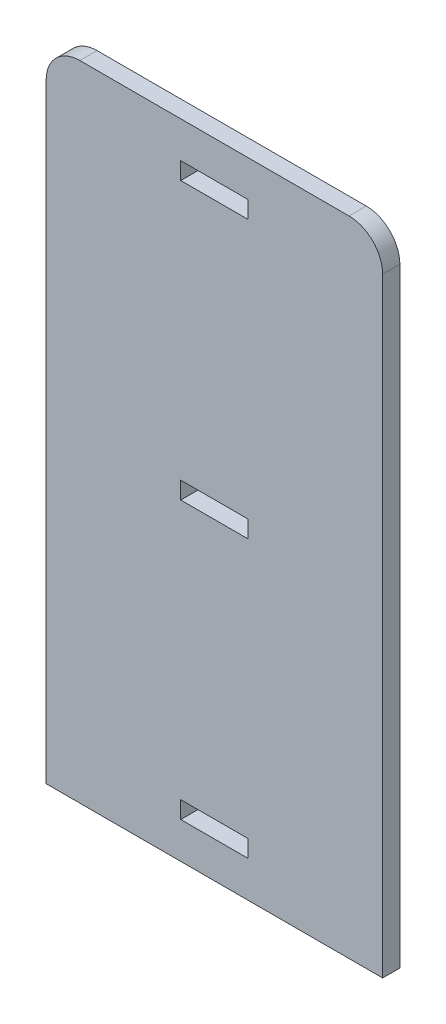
from build123d import *

# Parameters (mm, degrees)
CROQUIS1_W              = 90
CROQUIS1_H              = 23
SALIENTE_EXTRUIR1_DEPTH = 23


with BuildPart() as part:
    # Croquis1 → Saliente-Extruir1 (new body)
    with BuildSketch(Plane.XY):
        with BuildLine():
            Line((-224.582662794, 188.038781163), (-224.582662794, -626.961218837))
            Line((-224.582662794, -626.961218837), (225.417337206, -626.961218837))
            Line((225.417337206, -626.961218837), (225.417337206, 183.038781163))
            Line((225.417337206, 183.038781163), (225.417337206, 188.038781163))
            ThreePointArc((225.417337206, 188.038781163), (212.237142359, 219.858586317), (180.417337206, 233.038781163))
            Line((180.417337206, 233.038781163), (-179.582662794, 233.038781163))
            ThreePointArc((-179.582662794, 233.038781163), (-211.402467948, 219.858586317), (-224.582662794, 188.038781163))
        make_face()
        with Locations((0.417337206, -566.961218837)):
            Rectangle(CROQUIS1_W, CROQUIS1_H, mode=Mode.SUBTRACT)
        with Locations((0.417337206, -196.961218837)):
            Rectangle(CROQUIS1_W, CROQUIS1_H, mode=Mode.SUBTRACT)
        Polygon((45.417337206, 161.538781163), (-44.582662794, 161.538781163), (-44.582662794, 163.038781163), (-44.582662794, 183.038781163), (-44.582662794, 184.538781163), (45.417337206, 184.538781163), (45.417337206, 183.038781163), (45.417337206, 163.038781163), align=None, mode=Mode.SUBTRACT)
    extrude(amount=SALIENTE_EXTRUIR1_DEPTH)


solid = part.part
